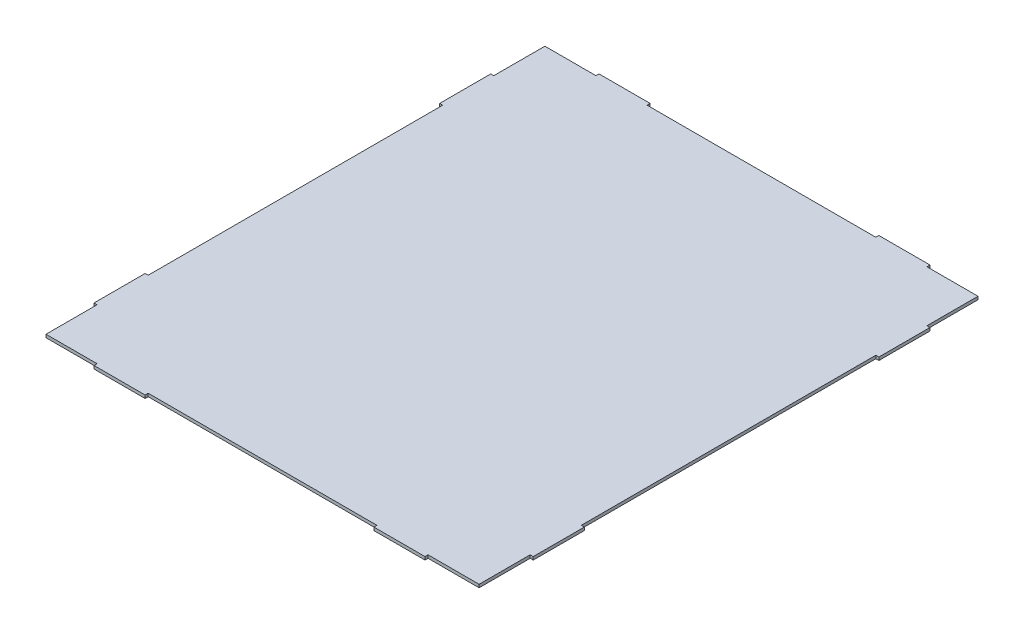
from build123d import *

# Parameters (mm, degrees)
BOSS_EXTRUDE1_DEPTH = 3


with BuildPart() as part:
    # Sketch1 → Boss-Extrude1 (new body)
    with BuildSketch(Plane(origin=(0, 0, 0), x_dir=(1, 0, 0), z_dir=(0, 1, 0))):
        Polygon((0, 0), (50, 0), (50, -3), (100, -3), (100, 0), (324, 0), (324, -3), (374, -3), (374, 0), (424, 0), (424, 50), (427, 50), (427, 100), (424, 100), (424, 388.4), (427, 388.4), (427, 438.4), (424, 438.4), (424, 488.4), (374, 488.4), (374, 491.4), (324, 491.4), (324, 488.4), (100, 488.4), (100, 491.4), (50, 491.4), (50, 488.4), (0, 488.4), (0, 438.4), (-3, 438.4), (-3, 388.4), (0, 388.4), (0, 100), (-3, 100), (-3, 50), (0, 50), align=None)
    extrude(amount=BOSS_EXTRUDE1_DEPTH)


solid = part.part
